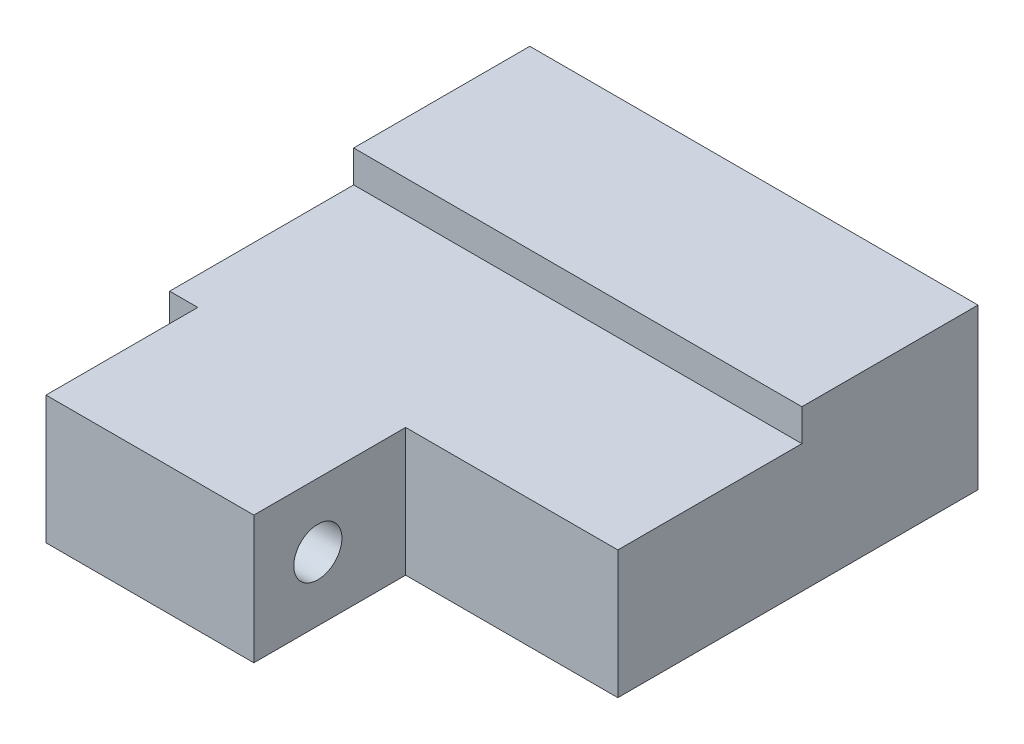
ISO-10303-21;
HEADER;
FILE_DESCRIPTION(('STEP AP214'),'2;1');
FILE_NAME('part.step','',(''),(''),'','','');
FILE_SCHEMA(('AUTOMOTIVE_DESIGN { 1 0 10303 214 1 1 1 1 }'));
ENDSEC;
DATA;
#1=APPLICATION_CONTEXT('core data for automotive mechanical design processes');
#2=APPLICATION_PROTOCOL_DEFINITION('international standard','automotive_design',2000,#1);
#3=PRODUCT_CONTEXT('',#1,'mechanical');
#4=PRODUCT('Part','Part','',(#3));
#5=PRODUCT_RELATED_PRODUCT_CATEGORY('part','',(#4));
#6=PRODUCT_DEFINITION_FORMATION('','',#4);
#7=PRODUCT_DEFINITION_CONTEXT('part definition',#1,'design');
#8=PRODUCT_DEFINITION('design','',#6,#7);
#9=PRODUCT_DEFINITION_SHAPE('','',#8);
#10=(LENGTH_UNIT() NAMED_UNIT(*) SI_UNIT(.MILLI.,.METRE.));
#11=(NAMED_UNIT(*) PLANE_ANGLE_UNIT() SI_UNIT($,.RADIAN.));
#12=(NAMED_UNIT(*) SI_UNIT($,.STERADIAN.) SOLID_ANGLE_UNIT());
#13=UNCERTAINTY_MEASURE_WITH_UNIT(LENGTH_MEASURE(1.E-05),#10,'distance_accuracy_value','');
#14=(GEOMETRIC_REPRESENTATION_CONTEXT(3) GLOBAL_UNCERTAINTY_ASSIGNED_CONTEXT((#13)) GLOBAL_UNIT_ASSIGNED_CONTEXT((#10,
#11,#12)) REPRESENTATION_CONTEXT('',''));
#15=CARTESIAN_POINT('',(0.,0.,0.));
#16=DIRECTION('',(0.,0.,1.));
#17=DIRECTION('',(1.,0.,0.));
#18=AXIS2_PLACEMENT_3D('',#15,#16,#17);
#19=CARTESIAN_POINT('',(-22.2377,4.7752,50.8));
#20=DIRECTION('',(1.,0.,0.));
#21=DIRECTION('',(0.,1.,0.));
#22=AXIS2_PLACEMENT_3D('',#19,#20,#21);
#23=PLANE('',#22);
#24=DIRECTION('',(0.,0.,1.));
#25=VECTOR('',#24,1.);
#26=CARTESIAN_POINT('',(-22.2377,1.6002,50.8));
#27=LINE('',#26,#25);
#28=CARTESIAN_POINT('',(-22.2377,1.6002,17.4752));
#29=VERTEX_POINT('',#28);
#30=CARTESIAN_POINT('',(-22.2377,1.6002,35.7378));
#31=VERTEX_POINT('',#30);
#32=EDGE_CURVE('E233',#29,#31,#27,.T.);
#33=ORIENTED_EDGE('',*,*,#32,.F.);
#34=DIRECTION('',(0.,-1.,0.));
#35=VECTOR('',#34,1.);
#36=CARTESIAN_POINT('',(-22.2377,4.7752,17.4752));
#37=LINE('',#36,#35);
#38=CARTESIAN_POINT('',(-22.2377,4.7752,17.4752));
#39=VERTEX_POINT('',#38);
#40=EDGE_CURVE('E138',#39,#29,#37,.T.);
#41=ORIENTED_EDGE('',*,*,#40,.F.);
#42=DIRECTION('',(0.,0.,-1.));
#43=VECTOR('',#42,1.);
#44=CARTESIAN_POINT('',(-22.2377,4.7752,50.8));
#45=LINE('',#44,#43);
#46=CARTESIAN_POINT('',(-22.2377,4.7752,0.));
#47=VERTEX_POINT('',#46);
#48=EDGE_CURVE('E191',#39,#47,#45,.T.);
#49=ORIENTED_EDGE('',*,*,#48,.T.);
#50=DIRECTION('',(0.,-1.,0.));
#51=VECTOR('',#50,1.);
#52=CARTESIAN_POINT('',(-22.2377,4.7752,0.));
#53=LINE('',#52,#51);
#54=CARTESIAN_POINT('',(-22.2377,-11.0998,0.));
#55=VERTEX_POINT('',#54);
#56=EDGE_CURVE('E187',#47,#55,#53,.T.);
#57=ORIENTED_EDGE('',*,*,#56,.T.);
#58=DIRECTION('',(0.,0.,-1.));
#59=VECTOR('',#58,1.);
#60=CARTESIAN_POINT('',(-22.2377,-11.0998,50.8));
#61=LINE('',#60,#59);
#62=CARTESIAN_POINT('',(-22.2377,-11.0998,35.7378));
#63=VERTEX_POINT('',#62);
#64=EDGE_CURVE('E206',#63,#55,#61,.T.);
#65=ORIENTED_EDGE('',*,*,#64,.F.);
#66=DIRECTION('',(0.,1.,0.));
#67=VECTOR('',#66,1.);
#68=CARTESIAN_POINT('',(-22.2377,-12.7,35.7378));
#69=LINE('',#68,#67);
#70=EDGE_CURVE('E167',#63,#31,#69,.T.);
#71=ORIENTED_EDGE('',*,*,#70,.T.);
#72=EDGE_LOOP('',(#33,#41,#49,#57,#65,#71));
#73=FACE_BOUND('',#72,.T.);
#74=ADVANCED_FACE('F45',(#73),#23,.F.);
#75=CARTESIAN_POINT('',(22.2377,-11.0998,50.8));
#76=DIRECTION('',(-1.,0.,0.));
#77=DIRECTION('',(0.,-1.,0.));
#78=AXIS2_PLACEMENT_3D('',#75,#76,#77);
#79=PLANE('',#78);
#80=DIRECTION('',(0.,0.,-1.));
#81=VECTOR('',#80,1.);
#82=CARTESIAN_POINT('',(22.2377,1.6002,50.8));
#83=LINE('',#82,#81);
#84=CARTESIAN_POINT('',(22.2377,1.6002,35.7378));
#85=VERTEX_POINT('',#84);
#86=CARTESIAN_POINT('',(22.2377,1.6002,17.4752));
#87=VERTEX_POINT('',#86);
#88=EDGE_CURVE('E121',#85,#87,#83,.T.);
#89=ORIENTED_EDGE('',*,*,#88,.F.);
#90=DIRECTION('',(0.,1.,0.));
#91=VECTOR('',#90,1.);
#92=CARTESIAN_POINT('',(22.2377,-12.7,35.7378));
#93=LINE('',#92,#91);
#94=CARTESIAN_POINT('',(22.2377,-11.0998,35.7378));
#95=VERTEX_POINT('',#94);
#96=EDGE_CURVE('E176',#95,#85,#93,.T.);
#97=ORIENTED_EDGE('',*,*,#96,.F.);
#98=DIRECTION('',(0.,0.,-1.));
#99=VECTOR('',#98,1.);
#100=CARTESIAN_POINT('',(22.2377,-11.0998,50.8));
#101=LINE('',#100,#99);
#102=CARTESIAN_POINT('',(22.2377,-11.0998,0.));
#103=VERTEX_POINT('',#102);
#104=EDGE_CURVE('E204',#95,#103,#101,.T.);
#105=ORIENTED_EDGE('',*,*,#104,.T.);
#106=DIRECTION('',(0.,1.,0.));
#107=VECTOR('',#106,1.);
#108=CARTESIAN_POINT('',(22.2377,-11.0998,0.));
#109=LINE('',#108,#107);
#110=CARTESIAN_POINT('',(22.2377,4.7752,0.));
#111=VERTEX_POINT('',#110);
#112=EDGE_CURVE('E198',#103,#111,#109,.T.);
#113=ORIENTED_EDGE('',*,*,#112,.T.);
#114=DIRECTION('',(0.,0.,-1.));
#115=VECTOR('',#114,1.);
#116=CARTESIAN_POINT('',(22.2377,4.7752,50.8));
#117=LINE('',#116,#115);
#118=CARTESIAN_POINT('',(22.2377,4.7752,17.4752));
#119=VERTEX_POINT('',#118);
#120=EDGE_CURVE('E145',#119,#111,#117,.T.);
#121=ORIENTED_EDGE('',*,*,#120,.F.);
#122=DIRECTION('',(0.,1.,0.));
#123=VECTOR('',#122,1.);
#124=CARTESIAN_POINT('',(22.2377,-11.0998,17.4752));
#125=LINE('',#124,#123);
#126=EDGE_CURVE('E132',#87,#119,#125,.T.);
#127=ORIENTED_EDGE('',*,*,#126,.F.);
#128=EDGE_LOOP('',(#89,#97,#105,#113,#121,#127));
#129=FACE_BOUND('',#128,.T.);
#130=ADVANCED_FACE('F143',(#129),#79,.F.);
#131=CARTESIAN_POINT('',(22.2377,4.7752,50.8));
#132=DIRECTION('',(0.,-1.,0.));
#133=DIRECTION('',(1.,0.,0.));
#134=AXIS2_PLACEMENT_3D('',#131,#132,#133);
#135=PLANE('',#134);
#136=DIRECTION('',(-1.,0.,0.));
#137=VECTOR('',#136,1.);
#138=CARTESIAN_POINT('',(38.1,4.7752,17.4752));
#139=LINE('',#138,#137);
#140=EDGE_CURVE('E140',#119,#39,#139,.T.);
#141=ORIENTED_EDGE('',*,*,#140,.F.);
#142=ORIENTED_EDGE('',*,*,#120,.T.);
#143=DIRECTION('',(-1.,0.,0.));
#144=VECTOR('',#143,1.);
#145=CARTESIAN_POINT('',(22.2377,4.7752,0.));
#146=LINE('',#145,#144);
#147=EDGE_CURVE('E192',#111,#47,#146,.T.);
#148=ORIENTED_EDGE('',*,*,#147,.T.);
#149=ORIENTED_EDGE('',*,*,#48,.F.);
#150=EDGE_LOOP('',(#141,#142,#148,#149));
#151=FACE_BOUND('',#150,.T.);
#152=ADVANCED_FACE('F250',(#151),#135,.F.);
#153=CARTESIAN_POINT('',(0.,0.,50.8));
#154=DIRECTION('',(0.,0.,1.));
#155=DIRECTION('',(1.,0.,0.));
#156=AXIS2_PLACEMENT_3D('',#153,#154,#155);
#157=PLANE('',#156);
#158=DIRECTION('',(0.,-1.,0.));
#159=VECTOR('',#158,1.);
#160=CARTESIAN_POINT('',(1.18110000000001,0.,50.8));
#161=LINE('',#160,#159);
#162=CARTESIAN_POINT('',(1.18110000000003,1.6002,50.8));
#163=VERTEX_POINT('',#162);
#164=CARTESIAN_POINT('',(1.18110000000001,-11.0998,50.8));
#165=VERTEX_POINT('',#164);
#166=EDGE_CURVE('E208',#163,#165,#161,.T.);
#167=ORIENTED_EDGE('',*,*,#166,.F.);
#168=DIRECTION('',(-1.,0.,0.));
#169=VECTOR('',#168,1.);
#170=CARTESIAN_POINT('',(38.1,1.6002,50.8));
#171=LINE('',#170,#169);
#172=CARTESIAN_POINT('',(-19.4437,1.6002,50.8));
#173=VERTEX_POINT('',#172);
#174=EDGE_CURVE('E139',#163,#173,#171,.T.);
#175=ORIENTED_EDGE('',*,*,#174,.T.);
#176=DIRECTION('',(0.,1.,0.));
#177=VECTOR('',#176,1.);
#178=CARTESIAN_POINT('',(-19.4437,0.,50.8));
#179=LINE('',#178,#177);
#180=CARTESIAN_POINT('',(-19.4437,-11.0998,50.8));
#181=VERTEX_POINT('',#180);
#182=EDGE_CURVE('E52',#181,#173,#179,.T.);
#183=ORIENTED_EDGE('',*,*,#182,.F.);
#184=DIRECTION('',(1.,0.,0.));
#185=VECTOR('',#184,1.);
#186=CARTESIAN_POINT('',(-22.2377,-11.0998,50.8));
#187=LINE('',#186,#185);
#188=EDGE_CURVE('E188',#181,#165,#187,.T.);
#189=ORIENTED_EDGE('',*,*,#188,.T.);
#190=EDGE_LOOP('',(#167,#175,#183,#189));
#191=FACE_BOUND('',#190,.T.);
#192=ADVANCED_FACE('F237',(#191),#157,.T.);
#193=CARTESIAN_POINT('',(22.2377,-12.7,35.7378));
#194=DIRECTION('',(0.,0.,-1.));
#195=DIRECTION('',(-1.,0.,0.));
#196=AXIS2_PLACEMENT_3D('',#193,#194,#195);
#197=PLANE('',#196);
#198=DIRECTION('',(1.,0.,0.));
#199=VECTOR('',#198,1.);
#200=CARTESIAN_POINT('',(22.2377,1.6002,35.7378));
#201=LINE('',#200,#199);
#202=CARTESIAN_POINT('',(1.18110000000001,1.6002,35.7378));
#203=VERTEX_POINT('',#202);
#204=EDGE_CURVE('E127',#203,#85,#201,.T.);
#205=ORIENTED_EDGE('',*,*,#204,.F.);
#206=DIRECTION('',(0.,1.,0.));
#207=VECTOR('',#206,1.);
#208=CARTESIAN_POINT('',(1.18110000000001,-12.7,35.7378));
#209=LINE('',#208,#207);
#210=CARTESIAN_POINT('',(1.18110000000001,-11.0998,35.7378));
#211=VERTEX_POINT('',#210);
#212=EDGE_CURVE('E177',#211,#203,#209,.T.);
#213=ORIENTED_EDGE('',*,*,#212,.F.);
#214=DIRECTION('',(-1.,0.,0.));
#215=VECTOR('',#214,1.);
#216=CARTESIAN_POINT('',(-22.2377,-11.0998,35.7378));
#217=LINE('',#216,#215);
#218=EDGE_CURVE('E184',#95,#211,#217,.T.);
#219=ORIENTED_EDGE('',*,*,#218,.F.);
#220=ORIENTED_EDGE('',*,*,#96,.T.);
#221=EDGE_LOOP('',(#205,#213,#219,#220));
#222=FACE_BOUND('',#221,.T.);
#223=ADVANCED_FACE('F227',(#222),#197,.F.);
#224=CARTESIAN_POINT('',(1.18110000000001,-12.7,35.7378));
#225=DIRECTION('',(-1.,0.,0.));
#226=DIRECTION('',(0.,0.,1.));
#227=AXIS2_PLACEMENT_3D('',#224,#225,#226);
#228=PLANE('',#227);
#229=CARTESIAN_POINT('',(1.18110000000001,-4.7498,44.45));
#230=DIRECTION('',(-1.,0.,0.));
#231=DIRECTION('',(0.,0.,1.));
#232=AXIS2_PLACEMENT_3D('',#229,#230,#231);
#233=CIRCLE('',#232,2.3876);
#234=CARTESIAN_POINT('',(1.18110000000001,-4.7498,46.8376));
#235=VERTEX_POINT('',#234);
#236=EDGE_CURVE('E163',#235,#235,#233,.T.);
#237=ORIENTED_EDGE('',*,*,#236,.T.);
#238=EDGE_LOOP('',(#237));
#239=FACE_BOUND('',#238,.T.);
#240=DIRECTION('',(0.,0.,-1.));
#241=VECTOR('',#240,1.);
#242=CARTESIAN_POINT('',(1.18110000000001,1.6002,35.7378));
#243=LINE('',#242,#241);
#244=EDGE_CURVE('E230',#163,#203,#243,.T.);
#245=ORIENTED_EDGE('',*,*,#244,.F.);
#246=ORIENTED_EDGE('',*,*,#166,.T.);
#247=DIRECTION('',(0.,0.,1.));
#248=VECTOR('',#247,1.);
#249=CARTESIAN_POINT('',(1.18110000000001,-11.0998,50.8));
#250=LINE('',#249,#248);
#251=EDGE_CURVE('E180',#211,#165,#250,.T.);
#252=ORIENTED_EDGE('',*,*,#251,.F.);
#253=ORIENTED_EDGE('',*,*,#212,.T.);
#254=EDGE_LOOP('',(#245,#246,#252,#253));
#255=FACE_BOUND('',#254,.T.);
#256=ADVANCED_FACE('F223',(#239,#255),#228,.F.);
#257=CARTESIAN_POINT('',(-19.4437,-12.7,35.7378));
#258=DIRECTION('',(0.,0.,-1.));
#259=DIRECTION('',(-1.,0.,0.));
#260=AXIS2_PLACEMENT_3D('',#257,#258,#259);
#261=PLANE('',#260);
#262=DIRECTION('',(1.,0.,0.));
#263=VECTOR('',#262,1.);
#264=CARTESIAN_POINT('',(-19.4437,1.6002,35.7378));
#265=LINE('',#264,#263);
#266=CARTESIAN_POINT('',(-19.4437,1.6002,35.7378));
#267=VERTEX_POINT('',#266);
#268=EDGE_CURVE('E58',#31,#267,#265,.T.);
#269=ORIENTED_EDGE('',*,*,#268,.F.);
#270=ORIENTED_EDGE('',*,*,#70,.F.);
#271=DIRECTION('',(-1.,0.,0.));
#272=VECTOR('',#271,1.);
#273=CARTESIAN_POINT('',(-22.2377,-11.0998,35.7378));
#274=LINE('',#273,#272);
#275=CARTESIAN_POINT('',(-19.4437,-11.0998,35.7378));
#276=VERTEX_POINT('',#275);
#277=EDGE_CURVE('E173',#276,#63,#274,.T.);
#278=ORIENTED_EDGE('',*,*,#277,.F.);
#279=DIRECTION('',(0.,1.,0.));
#280=VECTOR('',#279,1.);
#281=CARTESIAN_POINT('',(-19.4437,-12.7,35.7378));
#282=LINE('',#281,#280);
#283=EDGE_CURVE('E166',#276,#267,#282,.T.);
#284=ORIENTED_EDGE('',*,*,#283,.T.);
#285=EDGE_LOOP('',(#269,#270,#278,#284));
#286=FACE_BOUND('',#285,.T.);
#287=ADVANCED_FACE('F226',(#286),#261,.F.);
#288=CARTESIAN_POINT('',(-19.4437,-12.7,50.8));
#289=DIRECTION('',(1.,0.,0.));
#290=DIRECTION('',(0.,0.,-1.));
#291=AXIS2_PLACEMENT_3D('',#288,#289,#290);
#292=PLANE('',#291);
#293=CARTESIAN_POINT('',(-19.4437,-4.7498,44.45));
#294=DIRECTION('',(1.,0.,0.));
#295=DIRECTION('',(0.,0.,-1.));
#296=AXIS2_PLACEMENT_3D('',#293,#294,#295);
#297=CIRCLE('',#296,2.3876);
#298=CARTESIAN_POINT('',(-19.4437,-4.7498,42.0624));
#299=VERTEX_POINT('',#298);
#300=EDGE_CURVE('E160',#299,#299,#297,.T.);
#301=ORIENTED_EDGE('',*,*,#300,.T.);
#302=EDGE_LOOP('',(#301));
#303=FACE_BOUND('',#302,.T.);
#304=DIRECTION('',(0.,0.,1.));
#305=VECTOR('',#304,1.);
#306=CARTESIAN_POINT('',(-19.4437,1.6002,50.8));
#307=LINE('',#306,#305);
#308=EDGE_CURVE('E13',#267,#173,#307,.T.);
#309=ORIENTED_EDGE('',*,*,#308,.F.);
#310=ORIENTED_EDGE('',*,*,#283,.F.);
#311=DIRECTION('',(0.,0.,-1.));
#312=VECTOR('',#311,1.);
#313=CARTESIAN_POINT('',(-19.4437,-11.0998,50.8));
#314=LINE('',#313,#312);
#315=EDGE_CURVE('E66',#181,#276,#314,.T.);
#316=ORIENTED_EDGE('',*,*,#315,.F.);
#317=ORIENTED_EDGE('',*,*,#182,.T.);
#318=EDGE_LOOP('',(#309,#310,#316,#317));
#319=FACE_BOUND('',#318,.T.);
#320=ADVANCED_FACE('F213',(#303,#319),#292,.F.);
#321=CARTESIAN_POINT('',(-22.2377,-11.0998,50.8));
#322=DIRECTION('',(0.,1.,0.));
#323=DIRECTION('',(0.,0.,1.));
#324=AXIS2_PLACEMENT_3D('',#321,#322,#323);
#325=PLANE('',#324);
#326=ORIENTED_EDGE('',*,*,#315,.T.);
#327=ORIENTED_EDGE('',*,*,#277,.T.);
#328=ORIENTED_EDGE('',*,*,#64,.T.);
#329=DIRECTION('',(1.,0.,0.));
#330=VECTOR('',#329,1.);
#331=CARTESIAN_POINT('',(-22.2377,-11.0998,0.));
#332=LINE('',#331,#330);
#333=EDGE_CURVE('E195',#55,#103,#332,.T.);
#334=ORIENTED_EDGE('',*,*,#333,.T.);
#335=ORIENTED_EDGE('',*,*,#104,.F.);
#336=ORIENTED_EDGE('',*,*,#218,.T.);
#337=ORIENTED_EDGE('',*,*,#251,.T.);
#338=ORIENTED_EDGE('',*,*,#188,.F.);
#339=EDGE_LOOP('',(#326,#327,#328,#334,#335,#336,#337,#338));
#340=FACE_BOUND('',#339,.T.);
#341=ADVANCED_FACE('F240',(#340),#325,.F.);
#342=CARTESIAN_POINT('',(0.,0.,0.));
#343=DIRECTION('',(0.,0.,1.));
#344=DIRECTION('',(1.,0.,0.));
#345=AXIS2_PLACEMENT_3D('',#342,#343,#344);
#346=PLANE('',#345);
#347=CARTESIAN_POINT('',(-17.4625,0.,0.));
#348=DIRECTION('',(0.,0.,-1.));
#349=DIRECTION('',(-1.,0.,0.));
#350=AXIS2_PLACEMENT_3D('',#347,#348,#349);
#351=CIRCLE('',#350,2.3876);
#352=CARTESIAN_POINT('',(-19.8501,0.,0.));
#353=VERTEX_POINT('',#352);
#354=EDGE_CURVE('E147',#353,#353,#351,.T.);
#355=ORIENTED_EDGE('',*,*,#354,.F.);
#356=EDGE_LOOP('',(#355));
#357=FACE_BOUND('',#356,.T.);
#358=CARTESIAN_POINT('',(17.4625,0.,0.));
#359=DIRECTION('',(0.,0.,-1.));
#360=DIRECTION('',(-1.,0.,0.));
#361=AXIS2_PLACEMENT_3D('',#358,#359,#360);
#362=CIRCLE('',#361,2.3876);
#363=CARTESIAN_POINT('',(15.0749,0.,0.));
#364=VERTEX_POINT('',#363);
#365=EDGE_CURVE('E154',#364,#364,#362,.T.);
#366=ORIENTED_EDGE('',*,*,#365,.F.);
#367=EDGE_LOOP('',(#366));
#368=FACE_BOUND('',#367,.T.);
#369=ORIENTED_EDGE('',*,*,#56,.F.);
#370=ORIENTED_EDGE('',*,*,#147,.F.);
#371=ORIENTED_EDGE('',*,*,#112,.F.);
#372=ORIENTED_EDGE('',*,*,#333,.F.);
#373=EDGE_LOOP('',(#369,#370,#371,#372));
#374=FACE_BOUND('',#373,.T.);
#375=ADVANCED_FACE('F219',(#357,#368,#374),#346,.F.);
#376=CARTESIAN_POINT('',(-25.4,-4.7498,44.45));
#377=DIRECTION('',(1.,0.,0.));
#378=DIRECTION('',(0.,0.,-1.));
#379=AXIS2_PLACEMENT_3D('',#376,#377,#378);
#380=CYLINDRICAL_SURFACE('',#379,2.3876);
#381=ORIENTED_EDGE('',*,*,#300,.F.);
#382=EDGE_LOOP('',(#381));
#383=FACE_BOUND('',#382,.T.);
#384=ORIENTED_EDGE('',*,*,#236,.F.);
#385=EDGE_LOOP('',(#384));
#386=FACE_BOUND('',#385,.T.);
#387=ADVANCED_FACE('F215',(#383,#386),#380,.F.);
#388=CARTESIAN_POINT('',(17.4625,0.,15.875));
#389=DIRECTION('',(0.,0.,-1.));
#390=DIRECTION('',(-1.,0.,0.));
#391=AXIS2_PLACEMENT_3D('',#388,#389,#390);
#392=CYLINDRICAL_SURFACE('',#391,2.3876);
#393=CARTESIAN_POINT('',(17.4625,0.,15.875));
#394=DIRECTION('',(0.,0.,-1.));
#395=DIRECTION('',(-1.,0.,0.));
#396=AXIS2_PLACEMENT_3D('',#393,#394,#395);
#397=CIRCLE('',#396,2.3876);
#398=CARTESIAN_POINT('',(15.0749,0.,15.875));
#399=VERTEX_POINT('',#398);
#400=EDGE_CURVE('E157',#399,#399,#397,.T.);
#401=ORIENTED_EDGE('',*,*,#400,.F.);
#402=EDGE_LOOP('',(#401));
#403=FACE_BOUND('',#402,.T.);
#404=ORIENTED_EDGE('',*,*,#365,.T.);
#405=EDGE_LOOP('',(#404));
#406=FACE_BOUND('',#405,.T.);
#407=ADVANCED_FACE('F218',(#403,#406),#392,.F.);
#408=CARTESIAN_POINT('',(17.4625,0.,15.875));
#409=DIRECTION('',(0.,0.,-1.));
#410=DIRECTION('',(-1.,0.,0.));
#411=AXIS2_PLACEMENT_3D('',#408,#409,#410);
#412=PLANE('',#411);
#413=ORIENTED_EDGE('',*,*,#400,.T.);
#414=EDGE_LOOP('',(#413));
#415=FACE_BOUND('',#414,.T.);
#416=ADVANCED_FACE('F327',(#415),#412,.T.);
#417=CARTESIAN_POINT('',(-17.4625,0.,15.875));
#418=DIRECTION('',(0.,0.,-1.));
#419=DIRECTION('',(-1.,0.,0.));
#420=AXIS2_PLACEMENT_3D('',#417,#418,#419);
#421=CYLINDRICAL_SURFACE('',#420,2.3876);
#422=CARTESIAN_POINT('',(-17.4625,0.,15.875));
#423=DIRECTION('',(0.,0.,-1.));
#424=DIRECTION('',(-1.,0.,0.));
#425=AXIS2_PLACEMENT_3D('',#422,#423,#424);
#426=CIRCLE('',#425,2.3876);
#427=CARTESIAN_POINT('',(-19.8501,0.,15.875));
#428=VERTEX_POINT('',#427);
#429=EDGE_CURVE('E151',#428,#428,#426,.T.);
#430=ORIENTED_EDGE('',*,*,#429,.F.);
#431=EDGE_LOOP('',(#430));
#432=FACE_BOUND('',#431,.T.);
#433=ORIENTED_EDGE('',*,*,#354,.T.);
#434=EDGE_LOOP('',(#433));
#435=FACE_BOUND('',#434,.T.);
#436=ADVANCED_FACE('F323',(#432,#435),#421,.F.);
#437=CARTESIAN_POINT('',(-17.4625,0.,15.875));
#438=DIRECTION('',(0.,0.,-1.));
#439=DIRECTION('',(-1.,0.,0.));
#440=AXIS2_PLACEMENT_3D('',#437,#438,#439);
#441=PLANE('',#440);
#442=ORIENTED_EDGE('',*,*,#429,.T.);
#443=EDGE_LOOP('',(#442));
#444=FACE_BOUND('',#443,.T.);
#445=ADVANCED_FACE('F307',(#444),#441,.T.);
#446=CARTESIAN_POINT('',(38.1,4.7752,17.4752));
#447=DIRECTION('',(0.,0.,1.));
#448=DIRECTION('',(1.,0.,0.));
#449=AXIS2_PLACEMENT_3D('',#446,#447,#448);
#450=PLANE('',#449);
#451=ORIENTED_EDGE('',*,*,#40,.T.);
#452=DIRECTION('',(-1.,0.,0.));
#453=VECTOR('',#452,1.);
#454=CARTESIAN_POINT('',(38.1,1.6002,17.4752));
#455=LINE('',#454,#453);
#456=EDGE_CURVE('E124',#87,#29,#455,.T.);
#457=ORIENTED_EDGE('',*,*,#456,.F.);
#458=ORIENTED_EDGE('',*,*,#126,.T.);
#459=ORIENTED_EDGE('',*,*,#140,.T.);
#460=EDGE_LOOP('',(#451,#457,#458,#459));
#461=FACE_BOUND('',#460,.T.);
#462=ADVANCED_FACE('F135',(#461),#450,.T.);
#463=CARTESIAN_POINT('',(38.1,1.6002,17.4752));
#464=DIRECTION('',(0.,1.,0.));
#465=DIRECTION('',(0.,0.,1.));
#466=AXIS2_PLACEMENT_3D('',#463,#464,#465);
#467=PLANE('',#466);
#468=ORIENTED_EDGE('',*,*,#88,.T.);
#469=ORIENTED_EDGE('',*,*,#456,.T.);
#470=ORIENTED_EDGE('',*,*,#32,.T.);
#471=ORIENTED_EDGE('',*,*,#268,.T.);
#472=ORIENTED_EDGE('',*,*,#308,.T.);
#473=ORIENTED_EDGE('',*,*,#174,.F.);
#474=ORIENTED_EDGE('',*,*,#244,.T.);
#475=ORIENTED_EDGE('',*,*,#204,.T.);
#476=EDGE_LOOP('',(#468,#469,#470,#471,#472,#473,#474,#475));
#477=FACE_BOUND('',#476,.T.);
#478=ADVANCED_FACE('F123',(#477),#467,.T.);
#479=CLOSED_SHELL('',(#74,#130,#152,#192,#223,#256,#287,#320,#341,#375,#387,#407,#416,#436,#445,
#462,#478));
#480=MANIFOLD_SOLID_BREP('B2',#479);
#481=ADVANCED_BREP_SHAPE_REPRESENTATION('',(#18,#480),#14);
#482=SHAPE_DEFINITION_REPRESENTATION(#9,#481);
ENDSEC;
END-ISO-10303-21;
